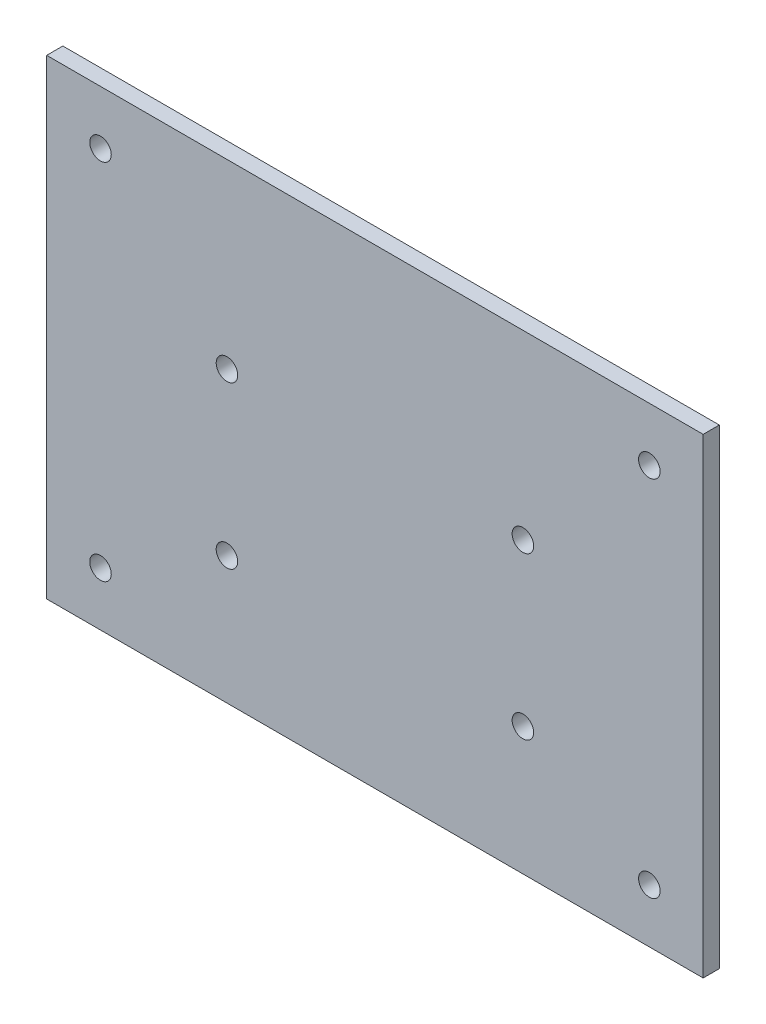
from build123d import *

# Parameters (mm, degrees)
SKETCH_1_W            = 122
SKETCH_1_H            = 87.5
EXTRUDE_1_DEPTH       = 3
HOLE_WIZARD_4_0_4_1_D = 4
HOLE_WIZARD_4_0_4_2_D = 4


with BuildPart() as part:
    # Sketch 1 → Extrude 1 (new body)
    with BuildSketch(Plane.XY):
        Rectangle(SKETCH_1_W, SKETCH_1_H)
    extrude(amount=EXTRUDE_1_DEPTH)

    # Hole Wizard 4.0 _4_ _1 (through all)
    with Locations(Plane.XY.offset(3)):
        with Locations((-27.5, 10), (-27.5, -20), (27.5, 10), (27.5, -20)):
            Hole(HOLE_WIZARD_4_0_4_1_D / 2)

    # Hole Wizard 4.0 _4_ _2 (through all)
    with Locations(Plane.XY.offset(3)):
        with Locations((-51, 33.75), (-51, -33.75), (51, 33.75), (51, -33.75)):
            Hole(HOLE_WIZARD_4_0_4_2_D / 2)


solid = part.part
